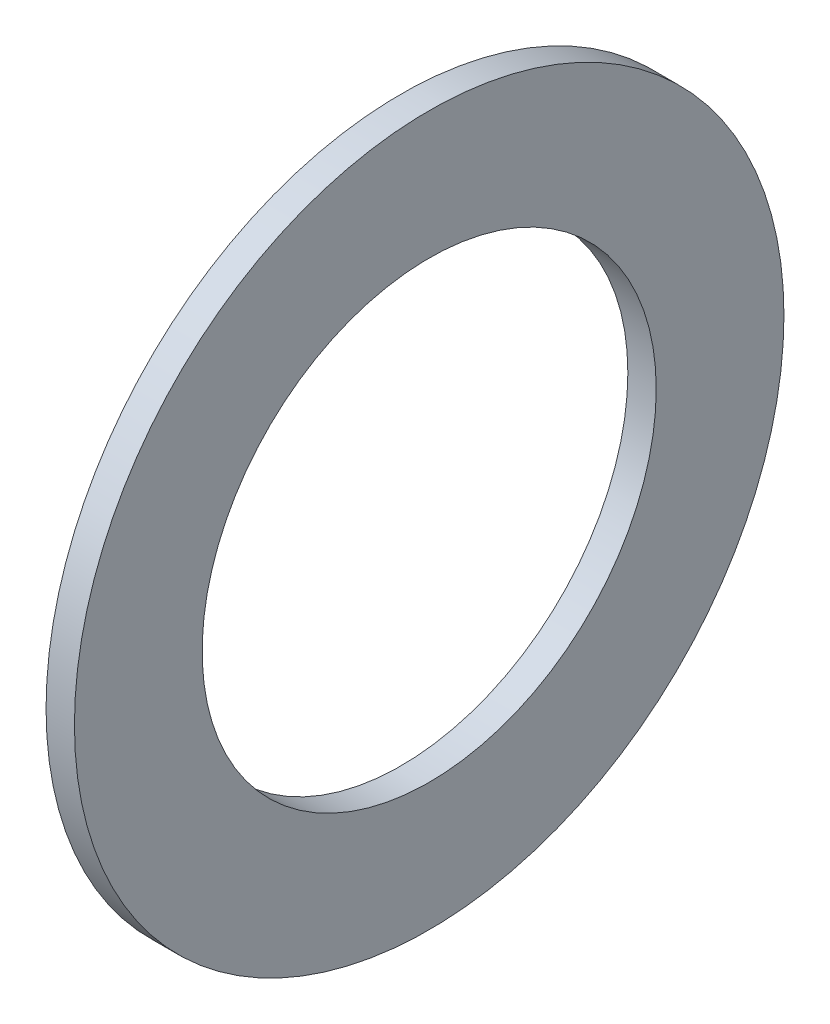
ISO-10303-21;
HEADER;
FILE_DESCRIPTION(('STEP AP214'),'2;1');
FILE_NAME('part.step','',(''),(''),'','','');
FILE_SCHEMA(('AUTOMOTIVE_DESIGN { 1 0 10303 214 1 1 1 1 }'));
ENDSEC;
DATA;
#1=APPLICATION_CONTEXT('core data for automotive mechanical design processes');
#2=APPLICATION_PROTOCOL_DEFINITION('international standard','automotive_design',2000,#1);
#3=PRODUCT_CONTEXT('',#1,'mechanical');
#4=PRODUCT('Part','Part','',(#3));
#5=PRODUCT_RELATED_PRODUCT_CATEGORY('part','',(#4));
#6=PRODUCT_DEFINITION_FORMATION('','',#4);
#7=PRODUCT_DEFINITION_CONTEXT('part definition',#1,'design');
#8=PRODUCT_DEFINITION('design','',#6,#7);
#9=PRODUCT_DEFINITION_SHAPE('','',#8);
#10=(LENGTH_UNIT() NAMED_UNIT(*) SI_UNIT(.MILLI.,.METRE.));
#11=(NAMED_UNIT(*) PLANE_ANGLE_UNIT() SI_UNIT($,.RADIAN.));
#12=(NAMED_UNIT(*) SI_UNIT($,.STERADIAN.) SOLID_ANGLE_UNIT());
#13=UNCERTAINTY_MEASURE_WITH_UNIT(LENGTH_MEASURE(1.E-05),#10,'distance_accuracy_value','');
#14=(GEOMETRIC_REPRESENTATION_CONTEXT(3) GLOBAL_UNCERTAINTY_ASSIGNED_CONTEXT((#13)) GLOBAL_UNIT_ASSIGNED_CONTEXT((#10,
#11,#12)) REPRESENTATION_CONTEXT('',''));
#15=CARTESIAN_POINT('',(0.,0.,0.));
#16=DIRECTION('',(0.,0.,1.));
#17=DIRECTION('',(1.,0.,0.));
#18=AXIS2_PLACEMENT_3D('',#15,#16,#17);
#19=CARTESIAN_POINT('',(0.2,0.,0.));
#20=DIRECTION('',(1.,0.,0.));
#21=DIRECTION('',(0.,0.,-1.));
#22=AXIS2_PLACEMENT_3D('',#19,#20,#21);
#23=PLANE('',#22);
#24=CARTESIAN_POINT('',(0.2,0.,0.));
#25=DIRECTION('',(1.,0.,0.));
#26=DIRECTION('',(0.,0.,-1.));
#27=AXIS2_PLACEMENT_3D('',#24,#25,#26);
#28=CIRCLE('',#27,2.5);
#29=CARTESIAN_POINT('',(0.2,0.,-2.5));
#30=VERTEX_POINT('',#29);
#31=EDGE_CURVE('E10',#30,#30,#28,.T.);
#32=ORIENTED_EDGE('',*,*,#31,.T.);
#33=EDGE_LOOP('',(#32));
#34=FACE_BOUND('',#33,.T.);
#35=CARTESIAN_POINT('',(0.2,0.,0.));
#36=DIRECTION('',(1.,0.,0.));
#37=DIRECTION('',(0.,0.,-1.));
#38=AXIS2_PLACEMENT_3D('',#35,#36,#37);
#39=CIRCLE('',#38,1.6);
#40=CARTESIAN_POINT('',(0.2,0.,-1.6));
#41=VERTEX_POINT('',#40);
#42=EDGE_CURVE('E44',#41,#41,#39,.T.);
#43=ORIENTED_EDGE('',*,*,#42,.F.);
#44=EDGE_LOOP('',(#43));
#45=FACE_BOUND('',#44,.T.);
#46=ADVANCED_FACE('F33',(#34,#45),#23,.T.);
#47=CARTESIAN_POINT('',(0.,0.,0.));
#48=DIRECTION('',(1.,0.,0.));
#49=DIRECTION('',(0.,0.,-1.));
#50=AXIS2_PLACEMENT_3D('',#47,#48,#49);
#51=PLANE('',#50);
#52=CARTESIAN_POINT('',(0.,0.,0.));
#53=DIRECTION('',(1.,0.,0.));
#54=DIRECTION('',(0.,0.,-1.));
#55=AXIS2_PLACEMENT_3D('',#52,#53,#54);
#56=CIRCLE('',#55,2.5);
#57=CARTESIAN_POINT('',(0.,0.,-2.5));
#58=VERTEX_POINT('',#57);
#59=EDGE_CURVE('E37',#58,#58,#56,.T.);
#60=ORIENTED_EDGE('',*,*,#59,.F.);
#61=EDGE_LOOP('',(#60));
#62=FACE_BOUND('',#61,.T.);
#63=CARTESIAN_POINT('',(0.,0.,0.));
#64=DIRECTION('',(1.,0.,0.));
#65=DIRECTION('',(0.,0.,-1.));
#66=AXIS2_PLACEMENT_3D('',#63,#64,#65);
#67=CIRCLE('',#66,1.6);
#68=CARTESIAN_POINT('',(0.,0.,-1.6));
#69=VERTEX_POINT('',#68);
#70=EDGE_CURVE('E46',#69,#69,#67,.T.);
#71=ORIENTED_EDGE('',*,*,#70,.T.);
#72=EDGE_LOOP('',(#71));
#73=FACE_BOUND('',#72,.T.);
#74=ADVANCED_FACE('F56',(#62,#73),#51,.F.);
#75=CARTESIAN_POINT('',(0.2,0.,0.));
#76=DIRECTION('',(-1.,0.,0.));
#77=DIRECTION('',(0.,0.,1.));
#78=AXIS2_PLACEMENT_3D('',#75,#76,#77);
#79=CYLINDRICAL_SURFACE('',#78,2.5);
#80=ORIENTED_EDGE('',*,*,#31,.F.);
#81=EDGE_LOOP('',(#80));
#82=FACE_BOUND('',#81,.T.);
#83=ORIENTED_EDGE('',*,*,#59,.T.);
#84=EDGE_LOOP('',(#83));
#85=FACE_BOUND('',#84,.T.);
#86=ADVANCED_FACE('F35',(#82,#85),#79,.T.);
#87=CARTESIAN_POINT('',(0.2,0.,0.));
#88=DIRECTION('',(-1.,0.,0.));
#89=DIRECTION('',(0.,0.,1.));
#90=AXIS2_PLACEMENT_3D('',#87,#88,#89);
#91=CYLINDRICAL_SURFACE('',#90,1.6);
#92=ORIENTED_EDGE('',*,*,#42,.T.);
#93=EDGE_LOOP('',(#92));
#94=FACE_BOUND('',#93,.T.);
#95=ORIENTED_EDGE('',*,*,#70,.F.);
#96=EDGE_LOOP('',(#95));
#97=FACE_BOUND('',#96,.T.);
#98=ADVANCED_FACE('F52',(#94,#97),#91,.F.);
#99=CLOSED_SHELL('',(#46,#74,#86,#98));
#100=MANIFOLD_SOLID_BREP('B2',#99);
#101=ADVANCED_BREP_SHAPE_REPRESENTATION('',(#18,#100),#14);
#102=SHAPE_DEFINITION_REPRESENTATION(#9,#101);
ENDSEC;
END-ISO-10303-21;
